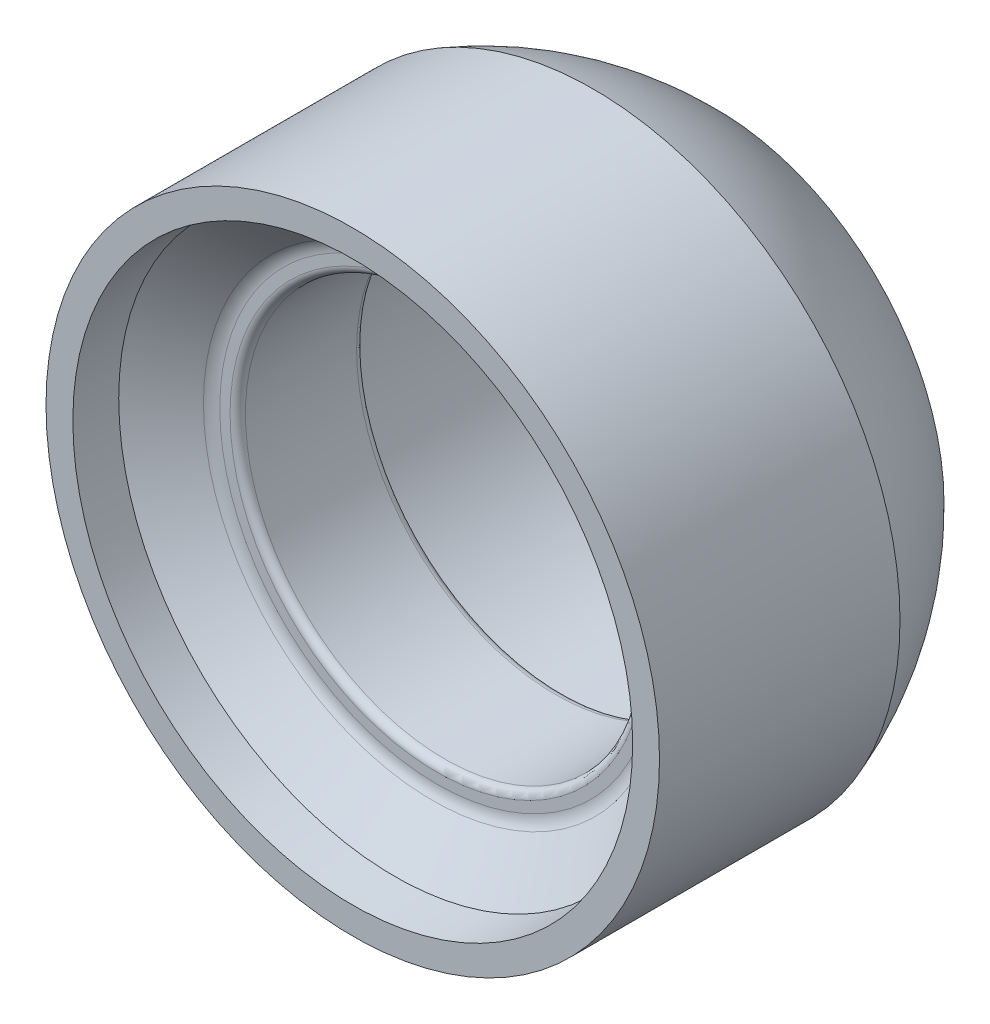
ISO-10303-21;
HEADER;
FILE_DESCRIPTION(('STEP AP214'),'2;1');
FILE_NAME('part.step','',(''),(''),'','','');
FILE_SCHEMA(('AUTOMOTIVE_DESIGN { 1 0 10303 214 1 1 1 1 }'));
ENDSEC;
DATA;
#1=APPLICATION_CONTEXT('core data for automotive mechanical design processes');
#2=APPLICATION_PROTOCOL_DEFINITION('international standard','automotive_design',2000,#1);
#3=PRODUCT_CONTEXT('',#1,'mechanical');
#4=PRODUCT('Part','Part','',(#3));
#5=PRODUCT_RELATED_PRODUCT_CATEGORY('part','',(#4));
#6=PRODUCT_DEFINITION_FORMATION('','',#4);
#7=PRODUCT_DEFINITION_CONTEXT('part definition',#1,'design');
#8=PRODUCT_DEFINITION('design','',#6,#7);
#9=PRODUCT_DEFINITION_SHAPE('','',#8);
#10=(LENGTH_UNIT() NAMED_UNIT(*) SI_UNIT(.MILLI.,.METRE.));
#11=(NAMED_UNIT(*) PLANE_ANGLE_UNIT() SI_UNIT($,.RADIAN.));
#12=(NAMED_UNIT(*) SI_UNIT($,.STERADIAN.) SOLID_ANGLE_UNIT());
#13=UNCERTAINTY_MEASURE_WITH_UNIT(LENGTH_MEASURE(1.E-05),#10,'distance_accuracy_value','');
#14=(GEOMETRIC_REPRESENTATION_CONTEXT(3) GLOBAL_UNCERTAINTY_ASSIGNED_CONTEXT((#13)) GLOBAL_UNIT_ASSIGNED_CONTEXT((#10,
#11,#12)) REPRESENTATION_CONTEXT('',''));
#15=CARTESIAN_POINT('',(0.,0.,0.));
#16=DIRECTION('',(0.,0.,1.));
#17=DIRECTION('',(1.,0.,0.));
#18=AXIS2_PLACEMENT_3D('',#15,#16,#17);
#19=CARTESIAN_POINT('',(0.,0.,-1.1));
#20=DIRECTION('',(0.,0.,1.));
#21=DIRECTION('',(1.,0.,0.));
#22=AXIS2_PLACEMENT_3D('',#19,#20,#21);
#23=CONICAL_SURFACE('',#22,7.20376247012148,0.0872664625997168);
#24=CARTESIAN_POINT('',(0.,0.,0.));
#25=DIRECTION('',(0.,0.,1.));
#26=DIRECTION('',(1.,0.,0.));
#27=AXIS2_PLACEMENT_3D('',#24,#25,#26);
#28=CIRCLE('',#27,7.3);
#29=CARTESIAN_POINT('',(7.3,0.,0.));
#30=VERTEX_POINT('',#29);
#31=EDGE_CURVE('E63',#30,#30,#28,.T.);
#32=ORIENTED_EDGE('',*,*,#31,.T.);
#33=EDGE_LOOP('',(#32));
#34=FACE_BOUND('',#33,.T.);
#35=CARTESIAN_POINT('',(0.,0.,-1.1));
#36=DIRECTION('',(0.,0.,1.));
#37=DIRECTION('',(1.,0.,0.));
#38=AXIS2_PLACEMENT_3D('',#35,#36,#37);
#39=CIRCLE('',#38,7.20376247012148);
#40=CARTESIAN_POINT('',(7.20376247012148,0.,-1.1));
#41=VERTEX_POINT('',#40);
#42=EDGE_CURVE('E78',#41,#41,#39,.T.);
#43=ORIENTED_EDGE('',*,*,#42,.F.);
#44=EDGE_LOOP('',(#43));
#45=FACE_BOUND('',#44,.T.);
#46=ADVANCED_FACE('F31',(#34,#45),#23,.F.);
#47=CARTESIAN_POINT('',(7.3,0.,0.));
#48=DIRECTION('',(0.,0.,1.));
#49=DIRECTION('',(1.,0.,0.));
#50=AXIS2_PLACEMENT_3D('',#47,#48,#49);
#51=PLANE('',#50);
#52=CARTESIAN_POINT('',(0.,0.,0.));
#53=DIRECTION('',(0.,0.,1.));
#54=DIRECTION('',(1.,0.,0.));
#55=AXIS2_PLACEMENT_3D('',#52,#53,#54);
#56=CIRCLE('',#55,8.);
#57=CARTESIAN_POINT('',(8.,0.,0.));
#58=VERTEX_POINT('',#57);
#59=EDGE_CURVE('E66',#58,#58,#56,.T.);
#60=ORIENTED_EDGE('',*,*,#59,.T.);
#61=EDGE_LOOP('',(#60));
#62=FACE_BOUND('',#61,.T.);
#63=ORIENTED_EDGE('',*,*,#31,.F.);
#64=EDGE_LOOP('',(#63));
#65=FACE_BOUND('',#64,.T.);
#66=ADVANCED_FACE('F85',(#62,#65),#51,.T.);
#67=CARTESIAN_POINT('',(0.,0.,0.));
#68=DIRECTION('',(0.,0.,1.));
#69=DIRECTION('',(1.,0.,0.));
#70=AXIS2_PLACEMENT_3D('',#67,#68,#69);
#71=CYLINDRICAL_SURFACE('',#70,8.);
#72=CARTESIAN_POINT('',(0.,0.,-6.27228132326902));
#73=DIRECTION('',(0.,0.,1.));
#74=DIRECTION('',(1.,0.,0.));
#75=AXIS2_PLACEMENT_3D('',#72,#73,#74);
#76=CIRCLE('',#75,8.);
#77=CARTESIAN_POINT('',(8.,0.,-6.27228132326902));
#78=VERTEX_POINT('',#77);
#79=EDGE_CURVE('E69',#78,#78,#76,.T.);
#80=ORIENTED_EDGE('',*,*,#79,.T.);
#81=EDGE_LOOP('',(#80));
#82=FACE_BOUND('',#81,.T.);
#83=ORIENTED_EDGE('',*,*,#59,.F.);
#84=EDGE_LOOP('',(#83));
#85=FACE_BOUND('',#84,.T.);
#86=ADVANCED_FACE('F91',(#82,#85),#71,.T.);
#87=CARTESIAN_POINT('',(0.,0.,-3.4));
#88=DIRECTION('',(0.,0.,1.));
#89=DIRECTION('',(1.,0.,0.));
#90=AXIS2_PLACEMENT_3D('',#87,#88,#89);
#91=SPHERICAL_SURFACE('',#90,8.5);
#92=CARTESIAN_POINT('',(0.,0.,-9.5));
#93=DIRECTION('',(0.,0.,1.));
#94=DIRECTION('',(1.,0.,0.));
#95=AXIS2_PLACEMENT_3D('',#92,#93,#94);
#96=CIRCLE('',#95,5.9194594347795);
#97=CARTESIAN_POINT('',(5.9194594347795,0.,-9.5));
#98=VERTEX_POINT('',#97);
#99=EDGE_CURVE('E72',#98,#98,#96,.T.);
#100=CARTESIAN_POINT('',(5.9194594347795,0.,-9.5));
#101=CARTESIAN_POINT('',(5.94841643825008,0.,-9.47190006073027));
#102=CARTESIAN_POINT('',(5.97717332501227,0.,-9.44359390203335));
#103=CARTESIAN_POINT('',(6.03428109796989,0.,-9.38657495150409));
#104=CARTESIAN_POINT('',(6.06263198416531,0.,-9.35786215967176));
#105=CARTESIAN_POINT('',(6.11892198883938,0.,-9.30003574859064));
#106=CARTESIAN_POINT('',(6.14686110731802,0.,-9.27092212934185));
#107=CARTESIAN_POINT('',(6.20232191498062,0.,-9.21229997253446));
#108=CARTESIAN_POINT('',(6.22984360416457,0.,-9.18279143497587));
#109=CARTESIAN_POINT('',(6.2844639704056,0.,-9.12338542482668));
#110=CARTESIAN_POINT('',(6.31156264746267,0.,-9.09348795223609));
#111=CARTESIAN_POINT('',(6.36533149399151,0.,-9.03331013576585));
#112=CARTESIAN_POINT('',(6.39200166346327,0.,-9.0030297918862));
#113=CARTESIAN_POINT('',(6.44490808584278,0.,-8.94209237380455));
#114=CARTESIAN_POINT('',(6.47114433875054,0.,-8.91143529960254));
#115=CARTESIAN_POINT('',(6.52317760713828,0.,-8.8497506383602));
#116=CARTESIAN_POINT('',(6.54897462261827,0.,-8.81872305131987));
#117=CARTESIAN_POINT('',(6.60012418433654,0.,-8.75630365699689));
#118=CARTESIAN_POINT('',(6.62547673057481,0.,-8.72491184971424));
#119=CARTESIAN_POINT('',(6.6757322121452,0.,-8.6617703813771));
#120=CARTESIAN_POINT('',(6.70063514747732,0.,-8.63002072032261));
#121=CARTESIAN_POINT('',(6.74998635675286,0.,-8.56616998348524));
#122=CARTESIAN_POINT('',(6.77443463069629,0.,-8.53406890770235));
#123=CARTESIAN_POINT('',(6.82287155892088,0.,-8.46952185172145));
#124=CARTESIAN_POINT('',(6.84686021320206,0.,-8.43707587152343));
#125=CARTESIAN_POINT('',(6.89437303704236,0.,-8.37184558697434));
#126=CARTESIAN_POINT('',(6.9178972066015,0.,-8.33906128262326));
#127=CARTESIAN_POINT('',(6.96447629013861,0.,-8.27316099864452));
#128=CARTESIAN_POINT('',(6.98753120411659,0.,-8.24004501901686));
#129=CARTESIAN_POINT('',(7.03316710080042,0.,-8.17348810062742));
#130=CARTESIAN_POINT('',(7.05574808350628,0.,-8.14004716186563));
#131=CARTESIAN_POINT('',(7.10043153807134,0.,-8.07284710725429));
#132=CARTESIAN_POINT('',(7.12253400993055,0.,-8.03908799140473));
#133=CARTESIAN_POINT('',(7.16625596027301,0.,-7.97125842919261));
#134=CARTESIAN_POINT('',(7.18787543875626,0.,-7.93718798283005));
#135=CARTESIAN_POINT('',(7.23062701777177,0.,-7.86874266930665));
#136=CARTESIAN_POINT('',(7.25175911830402,0.,-7.8343678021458));
#137=CARTESIAN_POINT('',(7.29353165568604,0.,-7.76532061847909));
#138=CARTESIAN_POINT('',(7.31417209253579,0.,-7.73064830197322));
#139=CARTESIAN_POINT('',(7.35495711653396,0.,-7.66101325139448));
#140=CARTESIAN_POINT('',(7.37510170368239,0.,-7.6260505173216));
#141=CARTESIAN_POINT('',(7.4148909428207,0.,-7.55584172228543));
#142=CARTESIAN_POINT('',(7.4345355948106,0.,-7.52059566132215));
#143=CARTESIAN_POINT('',(7.47332097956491,0.,-7.44982736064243));
#144=CARTESIAN_POINT('',(7.49246171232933,0.,-7.41430512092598));
#145=CARTESIAN_POINT('',(7.53023537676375,0.,-7.34299166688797));
#146=CARTESIAN_POINT('',(7.54886830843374,0.,-7.30720045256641));
#147=CARTESIAN_POINT('',(7.58562259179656,0.,-7.23535630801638));
#148=CARTESIAN_POINT('',(7.6037439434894,0.,-7.1993033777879));
#149=CARTESIAN_POINT('',(7.63947139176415,0.,-7.12694311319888));
#150=CARTESIAN_POINT('',(7.65707748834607,0.,-7.09063577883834));
#151=CARTESIAN_POINT('',(7.69177085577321,0.,-7.01777406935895));
#152=CARTESIAN_POINT('',(7.70885812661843,0.,-6.9812196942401));
#153=CARTESIAN_POINT('',(7.74251037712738,0.,-6.90787131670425));
#154=CARTESIAN_POINT('',(7.7590753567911,0.,-6.87107731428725));
#155=CARTESIAN_POINT('',(7.79167966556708,0.,-6.79725714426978));
#156=CARTESIAN_POINT('',(7.80771899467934,0.,-6.76023097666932));
#157=CARTESIAN_POINT('',(7.83926874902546,0.,-6.68595398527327));
#158=CARTESIAN_POINT('',(7.85477917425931,0.,-6.64870316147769));
#159=CARTESIAN_POINT('',(7.88526797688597,0.,-6.57398441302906));
#160=CARTESIAN_POINT('',(7.90024635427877,0.,-6.53651648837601));
#161=CARTESIAN_POINT('',(7.92966801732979,0.,-6.46137113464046));
#162=CARTESIAN_POINT('',(7.94411130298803,0.,-6.42369370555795));
#163=CARTESIAN_POINT('',(7.97245987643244,0.,-6.34813699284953));
#164=CARTESIAN_POINT('',(7.98636516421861,0.,-6.31025770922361));
#165=CARTESIAN_POINT('',(8.,0.,-6.27228132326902));
#166=B_SPLINE_CURVE_WITH_KNOTS('',3,(#100,#101,#102,#103,#104,#105,#106,#107,#108,#109,#110,
#111,#112,#113,#114,#115,#116,#117,#118,#119,#120,#121,#122,#123,#124,#125,#126,#127,#128,#129,
#130,#131,#132,#133,#134,#135,#136,#137,#138,#139,#140,#141,#142,#143,#144,#145,#146,#147,#148,
#149,#150,#151,#152,#153,#154,#155,#156,#157,#158,#159,#160,#161,#162,#163,#164,#165),
.UNSPECIFIED.,.F.,.F.,(4,2,2,2,2,2,2,2,2,2,2,2,2,2,2,2,2,2,2,2,2,2,2,2,2,2,2,2,2,2,2,2,4),(0.,
0.121048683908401,0.242097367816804,0.363146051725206,0.484194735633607,0.605243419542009,
0.726292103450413,0.847340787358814,0.968389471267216,1.08943815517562,1.21048683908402,
1.33153552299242,1.45258420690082,1.57363289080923,1.69468157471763,1.81573025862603,
1.93677894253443,2.05782762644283,2.17887631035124,2.29992499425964,2.42097367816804,
2.54202236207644,2.66307104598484,2.78411972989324,2.90516841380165,3.02621709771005,
3.14726578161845,3.26831446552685,3.38936314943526,3.51041183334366,3.63146051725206,
3.75250920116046,3.87355788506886),.UNSPECIFIED.);
#167=EDGE_CURVE('BSEAM124',#98,#78,#166,.T.);
#168=ORIENTED_EDGE('',*,*,#99,.T.);
#169=ORIENTED_EDGE('',*,*,#79,.F.);
#170=ORIENTED_EDGE('',*,*,#167,.T.);
#171=ORIENTED_EDGE('',*,*,#167,.F.);
#172=EDGE_LOOP('',(#168,#170,#169,#171));
#173=FACE_BOUND('',#172,.T.);
#174=ADVANCED_FACE('F124',(#173),#91,.T.);
#175=CARTESIAN_POINT('',(5.9194594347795,0.,-9.5));
#176=DIRECTION('',(0.,0.,-1.));
#177=DIRECTION('',(-1.,0.,0.));
#178=AXIS2_PLACEMENT_3D('',#175,#176,#177);
#179=PLANE('',#178);
#180=CARTESIAN_POINT('',(0.,0.,-9.5));
#181=DIRECTION('',(0.,0.,1.));
#182=DIRECTION('',(1.,0.,0.));
#183=AXIS2_PLACEMENT_3D('',#180,#181,#182);
#184=CIRCLE('',#183,5.75);
#185=CARTESIAN_POINT('',(5.75,0.,-9.5));
#186=VERTEX_POINT('',#185);
#187=EDGE_CURVE('E75',#186,#186,#184,.T.);
#188=ORIENTED_EDGE('',*,*,#187,.T.);
#189=EDGE_LOOP('',(#188));
#190=FACE_BOUND('',#189,.T.);
#191=ORIENTED_EDGE('',*,*,#99,.F.);
#192=EDGE_LOOP('',(#191));
#193=FACE_BOUND('',#192,.T.);
#194=ADVANCED_FACE('F118',(#190,#193),#179,.T.);
#195=CARTESIAN_POINT('',(0.,0.,0.));
#196=DIRECTION('',(0.,0.,1.));
#197=DIRECTION('',(1.,0.,0.));
#198=AXIS2_PLACEMENT_3D('',#195,#196,#197);
#199=CYLINDRICAL_SURFACE('',#198,5.75);
#200=CARTESIAN_POINT('',(0.,0.,-5.7));
#201=DIRECTION('',(0.,0.,-1.));
#202=DIRECTION('',(-1.,0.,0.));
#203=AXIS2_PLACEMENT_3D('',#200,#201,#202);
#204=CIRCLE('',#203,5.75);
#205=CARTESIAN_POINT('',(-5.75,0.,-5.7));
#206=VERTEX_POINT('',#205);
#207=EDGE_CURVE('E42',#206,#206,#204,.F.);
#208=ORIENTED_EDGE('',*,*,#207,.T.);
#209=EDGE_LOOP('',(#208));
#210=FACE_BOUND('',#209,.T.);
#211=ORIENTED_EDGE('',*,*,#187,.F.);
#212=EDGE_LOOP('',(#211));
#213=FACE_BOUND('',#212,.T.);
#214=ADVANCED_FACE('F114',(#210,#213),#199,.F.);
#215=CARTESIAN_POINT('',(5.2,0.,-5.5));
#216=DIRECTION('',(0.,0.,-1.));
#217=DIRECTION('',(-1.,0.,0.));
#218=AXIS2_PLACEMENT_3D('',#215,#216,#217);
#219=PLANE('',#218);
#220=CARTESIAN_POINT('',(0.,0.,-5.5));
#221=DIRECTION('',(0.,0.,-1.));
#222=DIRECTION('',(-1.,0.,0.));
#223=AXIS2_PLACEMENT_3D('',#220,#221,#222);
#224=CIRCLE('',#223,5.4);
#225=CARTESIAN_POINT('',(-5.4,0.,-5.5));
#226=VERTEX_POINT('',#225);
#227=EDGE_CURVE('E57',#226,#226,#224,.F.);
#228=ORIENTED_EDGE('',*,*,#227,.T.);
#229=EDGE_LOOP('',(#228));
#230=FACE_BOUND('',#229,.T.);
#231=CARTESIAN_POINT('',(0.,0.,-5.5));
#232=DIRECTION('',(0.,0.,-1.));
#233=DIRECTION('',(-1.,0.,0.));
#234=AXIS2_PLACEMENT_3D('',#231,#232,#233);
#235=CIRCLE('',#234,5.55);
#236=CARTESIAN_POINT('',(-5.55,0.,-5.5));
#237=VERTEX_POINT('',#236);
#238=EDGE_CURVE('E60',#237,#237,#235,.T.);
#239=ORIENTED_EDGE('',*,*,#238,.T.);
#240=EDGE_LOOP('',(#239));
#241=FACE_BOUND('',#240,.T.);
#242=ADVANCED_FACE('F117',(#230,#241),#219,.T.);
#243=CARTESIAN_POINT('',(0.,0.,0.));
#244=DIRECTION('',(0.,0.,1.));
#245=DIRECTION('',(1.,0.,0.));
#246=AXIS2_PLACEMENT_3D('',#243,#244,#245);
#247=CYLINDRICAL_SURFACE('',#246,5.2);
#248=CARTESIAN_POINT('',(0.,0.,-5.3));
#249=DIRECTION('',(0.,0.,-1.));
#250=DIRECTION('',(-1.,0.,0.));
#251=AXIS2_PLACEMENT_3D('',#248,#249,#250);
#252=CIRCLE('',#251,5.2);
#253=CARTESIAN_POINT('',(-5.2,0.,-5.3));
#254=VERTEX_POINT('',#253);
#255=EDGE_CURVE('E51',#254,#254,#252,.T.);
#256=ORIENTED_EDGE('',*,*,#255,.T.);
#257=EDGE_LOOP('',(#256));
#258=FACE_BOUND('',#257,.T.);
#259=CARTESIAN_POINT('',(0.,0.,-2.4));
#260=DIRECTION('',(0.,0.,1.));
#261=DIRECTION('',(1.,0.,0.));
#262=AXIS2_PLACEMENT_3D('',#259,#260,#261);
#263=CIRCLE('',#262,5.2);
#264=CARTESIAN_POINT('',(5.2,0.,-2.4));
#265=VERTEX_POINT('',#264);
#266=EDGE_CURVE('E54',#265,#265,#263,.T.);
#267=ORIENTED_EDGE('',*,*,#266,.T.);
#268=EDGE_LOOP('',(#267));
#269=FACE_BOUND('',#268,.T.);
#270=ADVANCED_FACE('F143',(#258,#269),#247,.F.);
#271=CARTESIAN_POINT('',(5.84537559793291,0.,-2.2));
#272=DIRECTION('',(0.,0.,1.));
#273=DIRECTION('',(1.,0.,0.));
#274=AXIS2_PLACEMENT_3D('',#271,#272,#273);
#275=PLANE('',#274);
#276=CARTESIAN_POINT('',(0.,0.,-2.2));
#277=DIRECTION('',(0.,0.,1.));
#278=DIRECTION('',(1.,0.,0.));
#279=AXIS2_PLACEMENT_3D('',#276,#277,#278);
#280=CIRCLE('',#279,5.66831631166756);
#281=CARTESIAN_POINT('',(5.66831631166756,0.,-2.2));
#282=VERTEX_POINT('',#281);
#283=EDGE_CURVE('E38',#282,#282,#280,.T.);
#284=ORIENTED_EDGE('',*,*,#283,.T.);
#285=EDGE_LOOP('',(#284));
#286=FACE_BOUND('',#285,.T.);
#287=CARTESIAN_POINT('',(0.,0.,-2.2));
#288=DIRECTION('',(0.,0.,1.));
#289=DIRECTION('',(1.,0.,0.));
#290=AXIS2_PLACEMENT_3D('',#287,#288,#289);
#291=CIRCLE('',#290,5.4);
#292=CARTESIAN_POINT('',(5.4,0.,-2.2));
#293=VERTEX_POINT('',#292);
#294=EDGE_CURVE('E46',#293,#293,#291,.F.);
#295=ORIENTED_EDGE('',*,*,#294,.T.);
#296=EDGE_LOOP('',(#295));
#297=FACE_BOUND('',#296,.T.);
#298=ADVANCED_FACE('F147',(#286,#297),#275,.T.);
#299=CARTESIAN_POINT('',(0.,0.,-2.2));
#300=DIRECTION('',(0.,0.,1.));
#301=DIRECTION('',(1.,0.,0.));
#302=AXIS2_PLACEMENT_3D('',#299,#300,#301);
#303=CONICAL_SURFACE('',#302,5.84537559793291,0.890117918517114);
#304=CARTESIAN_POINT('',(0.,0.,-2.08857298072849));
#305=DIRECTION('',(0.,0.,1.));
#306=DIRECTION('',(1.,0.,0.));
#307=AXIS2_PLACEMENT_3D('',#304,#305,#306);
#308=CIRCLE('',#307,5.98297650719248);
#309=CARTESIAN_POINT('',(5.98297650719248,0.,-2.08857298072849));
#310=VERTEX_POINT('',#309);
#311=EDGE_CURVE('E10',#310,#310,#308,.F.);
#312=ORIENTED_EDGE('',*,*,#311,.T.);
#313=EDGE_LOOP('',(#312));
#314=FACE_BOUND('',#313,.T.);
#315=ORIENTED_EDGE('',*,*,#42,.T.);
#316=EDGE_LOOP('',(#315));
#317=FACE_BOUND('',#316,.T.);
#318=ADVANCED_FACE('F82',(#314,#317),#303,.F.);
#319=CARTESIAN_POINT('',(0.,0.,-5.3));
#320=DIRECTION('',(0.,0.,-1.));
#321=DIRECTION('',(-1.,0.,0.));
#322=AXIS2_PLACEMENT_3D('',#319,#320,#321);
#323=TOROIDAL_SURFACE('',#322,5.4,0.2);
#324=ORIENTED_EDGE('',*,*,#255,.F.);
#325=EDGE_LOOP('',(#324));
#326=FACE_BOUND('',#325,.T.);
#327=ORIENTED_EDGE('',*,*,#227,.F.);
#328=EDGE_LOOP('',(#327));
#329=FACE_BOUND('',#328,.T.);
#330=ADVANCED_FACE('F96',(#326,#329),#323,.T.);
#331=CARTESIAN_POINT('',(0.,0.,-2.4));
#332=DIRECTION('',(0.,0.,1.));
#333=DIRECTION('',(1.,0.,0.));
#334=AXIS2_PLACEMENT_3D('',#331,#332,#333);
#335=TOROIDAL_SURFACE('',#334,5.4,0.2);
#336=ORIENTED_EDGE('',*,*,#294,.F.);
#337=EDGE_LOOP('',(#336));
#338=FACE_BOUND('',#337,.T.);
#339=ORIENTED_EDGE('',*,*,#266,.F.);
#340=EDGE_LOOP('',(#339));
#341=FACE_BOUND('',#340,.T.);
#342=ADVANCED_FACE('F99',(#338,#341),#335,.T.);
#343=CARTESIAN_POINT('',(0.,0.,-5.7));
#344=DIRECTION('',(0.,0.,-1.));
#345=DIRECTION('',(-1.,0.,0.));
#346=AXIS2_PLACEMENT_3D('',#343,#344,#345);
#347=TOROIDAL_SURFACE('',#346,5.55,0.2);
#348=ORIENTED_EDGE('',*,*,#238,.F.);
#349=EDGE_LOOP('',(#348));
#350=FACE_BOUND('',#349,.T.);
#351=ORIENTED_EDGE('',*,*,#207,.F.);
#352=EDGE_LOOP('',(#351));
#353=FACE_BOUND('',#352,.T.);
#354=ADVANCED_FACE('F102',(#350,#353),#347,.F.);
#355=CARTESIAN_POINT('',(0.,0.,-1.7));
#356=DIRECTION('',(0.,0.,1.));
#357=DIRECTION('',(1.,0.,0.));
#358=AXIS2_PLACEMENT_3D('',#355,#356,#357);
#359=TOROIDAL_SURFACE('',#358,5.66831631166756,0.5);
#360=ORIENTED_EDGE('',*,*,#311,.F.);
#361=EDGE_LOOP('',(#360));
#362=FACE_BOUND('',#361,.T.);
#363=ORIENTED_EDGE('',*,*,#283,.F.);
#364=EDGE_LOOP('',(#363));
#365=FACE_BOUND('',#364,.T.);
#366=ADVANCED_FACE('F33',(#362,#365),#359,.F.);
#367=CLOSED_SHELL('',(#46,#66,#86,#174,#194,#214,#242,#270,#298,#318,#330,#342,#354,#366));
#368=MANIFOLD_SOLID_BREP('B2',#367);
#369=ADVANCED_BREP_SHAPE_REPRESENTATION('',(#18,#368),#14);
#370=SHAPE_DEFINITION_REPRESENTATION(#9,#369);
ENDSEC;
END-ISO-10303-21;
